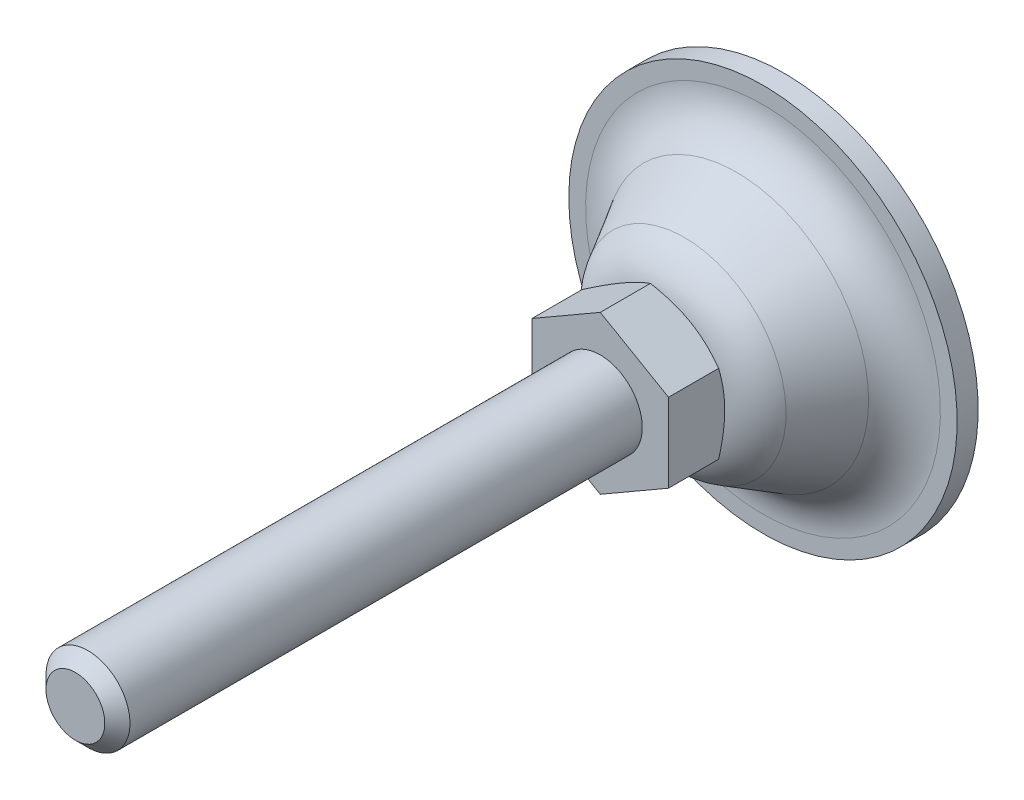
ISO-10303-21;
HEADER;
FILE_DESCRIPTION(('STEP AP214'),'2;1');
FILE_NAME('part.step','',(''),(''),'','','');
FILE_SCHEMA(('AUTOMOTIVE_DESIGN { 1 0 10303 214 1 1 1 1 }'));
ENDSEC;
DATA;
#1=APPLICATION_CONTEXT('core data for automotive mechanical design processes');
#2=APPLICATION_PROTOCOL_DEFINITION('international standard','automotive_design',2000,#1);
#3=PRODUCT_CONTEXT('',#1,'mechanical');
#4=PRODUCT('Part','Part','',(#3));
#5=PRODUCT_RELATED_PRODUCT_CATEGORY('part','',(#4));
#6=PRODUCT_DEFINITION_FORMATION('','',#4);
#7=PRODUCT_DEFINITION_CONTEXT('part definition',#1,'design');
#8=PRODUCT_DEFINITION('design','',#6,#7);
#9=PRODUCT_DEFINITION_SHAPE('','',#8);
#10=(LENGTH_UNIT() NAMED_UNIT(*) SI_UNIT(.MILLI.,.METRE.));
#11=(NAMED_UNIT(*) PLANE_ANGLE_UNIT() SI_UNIT($,.RADIAN.));
#12=(NAMED_UNIT(*) SI_UNIT($,.STERADIAN.) SOLID_ANGLE_UNIT());
#13=UNCERTAINTY_MEASURE_WITH_UNIT(LENGTH_MEASURE(1.E-05),#10,'distance_accuracy_value','');
#14=(GEOMETRIC_REPRESENTATION_CONTEXT(3) GLOBAL_UNCERTAINTY_ASSIGNED_CONTEXT((#13)) GLOBAL_UNIT_ASSIGNED_CONTEXT((#10,
#11,#12)) REPRESENTATION_CONTEXT('',''));
#15=CARTESIAN_POINT('',(0.,0.,0.));
#16=DIRECTION('',(0.,0.,1.));
#17=DIRECTION('',(1.,0.,0.));
#18=AXIS2_PLACEMENT_3D('',#15,#16,#17);
#19=CARTESIAN_POINT('',(-9.25,16.0214699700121,1.9999991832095));
#20=DIRECTION('',(0.,0.,-1.));
#21=DIRECTION('',(-0.5,0.86602540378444,0.));
#22=AXIS2_PLACEMENT_3D('',#19,#20,#21);
#23=PLANE('',#22);
#24=CARTESIAN_POINT('',(0.,0.,1.9999991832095));
#25=DIRECTION('',(0.,0.,1.));
#26=DIRECTION('',(0.5,-0.86602540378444,0.));
#27=AXIS2_PLACEMENT_3D('',#24,#25,#26);
#28=CIRCLE('',#27,16.8976413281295);
#29=CARTESIAN_POINT('',(8.44882066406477,-14.633786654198,1.9999991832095));
#30=VERTEX_POINT('',#29);
#31=EDGE_CURVE('E108',#30,#30,#28,.T.);
#32=ORIENTED_EDGE('',*,*,#31,.F.);
#33=EDGE_LOOP('',(#32));
#34=FACE_BOUND('',#33,.T.);
#35=CARTESIAN_POINT('',(0.,0.,2.));
#36=DIRECTION('',(0.,0.,-1.));
#37=DIRECTION('',(-1.,0.,0.));
#38=AXIS2_PLACEMENT_3D('',#35,#36,#37);
#39=CIRCLE('',#38,18.5);
#40=CARTESIAN_POINT('',(-18.5,0.,2.));
#41=VERTEX_POINT('',#40);
#42=EDGE_CURVE('E206',#41,#41,#39,.T.);
#43=ORIENTED_EDGE('',*,*,#42,.F.);
#44=EDGE_LOOP('',(#43));
#45=FACE_BOUND('',#44,.T.);
#46=ADVANCED_FACE('F14',(#34,#45),#23,.F.);
#47=CARTESIAN_POINT('',(0.,0.,17.5));
#48=DIRECTION('',(0.,0.,1.));
#49=DIRECTION('',(0.5,-0.86602540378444,0.));
#50=AXIS2_PLACEMENT_3D('',#47,#48,#49);
#51=PLANE('',#50);
#52=DIRECTION('',(0.,1.,0.));
#53=VECTOR('',#52,1.);
#54=CARTESIAN_POINT('',(6.5,-3.75277674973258,17.5));
#55=LINE('',#54,#53);
#56=CARTESIAN_POINT('',(6.5,-3.75277674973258,17.5));
#57=VERTEX_POINT('',#56);
#58=CARTESIAN_POINT('',(6.5,3.75277674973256,17.5));
#59=VERTEX_POINT('',#58);
#60=EDGE_CURVE('E371',#57,#59,#55,.T.);
#61=ORIENTED_EDGE('',*,*,#60,.T.);
#62=DIRECTION('',(-0.866025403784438,0.5,0.));
#63=VECTOR('',#62,1.);
#64=CARTESIAN_POINT('',(6.5,3.75277674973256,17.5));
#65=LINE('',#64,#63);
#66=CARTESIAN_POINT('',(0.,7.50555349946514,17.5));
#67=VERTEX_POINT('',#66);
#68=EDGE_CURVE('E368',#59,#67,#65,.T.);
#69=ORIENTED_EDGE('',*,*,#68,.T.);
#70=DIRECTION('',(-0.866025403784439,-0.5,0.));
#71=VECTOR('',#70,1.);
#72=CARTESIAN_POINT('',(0.,7.50555349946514,17.5));
#73=LINE('',#72,#71);
#74=CARTESIAN_POINT('',(-6.5,3.75277674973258,17.5));
#75=VERTEX_POINT('',#74);
#76=EDGE_CURVE('E367',#67,#75,#73,.T.);
#77=ORIENTED_EDGE('',*,*,#76,.T.);
#78=DIRECTION('',(0.,-1.,0.));
#79=VECTOR('',#78,1.);
#80=CARTESIAN_POINT('',(-6.5,3.75277674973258,17.5));
#81=LINE('',#80,#79);
#82=CARTESIAN_POINT('',(-6.5,-3.75277674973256,17.5));
#83=VERTEX_POINT('',#82);
#84=EDGE_CURVE('E375',#75,#83,#81,.T.);
#85=ORIENTED_EDGE('',*,*,#84,.T.);
#86=DIRECTION('',(0.866025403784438,-0.5,0.));
#87=VECTOR('',#86,1.);
#88=CARTESIAN_POINT('',(-6.5,-3.75277674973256,17.5));
#89=LINE('',#88,#87);
#90=CARTESIAN_POINT('',(0.,-7.50555349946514,17.5));
#91=VERTEX_POINT('',#90);
#92=EDGE_CURVE('E377',#83,#91,#89,.T.);
#93=ORIENTED_EDGE('',*,*,#92,.T.);
#94=DIRECTION('',(0.866025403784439,0.5,0.));
#95=VECTOR('',#94,1.);
#96=CARTESIAN_POINT('',(0.,-7.50555349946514,17.5));
#97=LINE('',#96,#95);
#98=EDGE_CURVE('E37',#91,#57,#97,.T.);
#99=ORIENTED_EDGE('',*,*,#98,.T.);
#100=EDGE_LOOP('',(#61,#69,#77,#85,#93,#99));
#101=FACE_BOUND('',#100,.T.);
#102=CARTESIAN_POINT('',(0.,0.,17.5));
#103=DIRECTION('',(0.,0.,1.));
#104=DIRECTION('',(0.5,-0.86602540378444,0.));
#105=AXIS2_PLACEMENT_3D('',#102,#103,#104);
#106=CIRCLE('',#105,4.);
#107=CARTESIAN_POINT('',(2.,-3.46410161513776,17.5));
#108=VERTEX_POINT('',#107);
#109=EDGE_CURVE('E211',#108,#108,#106,.T.);
#110=ORIENTED_EDGE('',*,*,#109,.F.);
#111=EDGE_LOOP('',(#110));
#112=FACE_BOUND('',#111,.T.);
#113=ADVANCED_FACE('F129',(#101,#112),#51,.T.);
#114=CARTESIAN_POINT('',(0.,0.,7.));
#115=DIRECTION('',(0.,0.,1.));
#116=DIRECTION('',(0.5,-0.86602540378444,0.));
#117=AXIS2_PLACEMENT_3D('',#114,#115,#116);
#118=TOROIDAL_SURFACE('',#117,5.36011171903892,5.);
#119=CARTESIAN_POINT('',(0.,0.,12.));
#120=DIRECTION('',(0.,0.,1.));
#121=DIRECTION('',(0.5,-0.86602540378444,0.));
#122=AXIS2_PLACEMENT_3D('',#119,#120,#121);
#123=CIRCLE('',#122,5.36011171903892);
#124=CARTESIAN_POINT('',(2.68005585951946,-4.64199291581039,12.));
#125=VERTEX_POINT('',#124);
#126=EDGE_CURVE('E73',#125,#125,#123,.T.);
#127=ORIENTED_EDGE('',*,*,#126,.F.);
#128=EDGE_LOOP('',(#127));
#129=FACE_BOUND('',#128,.T.);
#130=CARTESIAN_POINT('',(0.,0.,9.49382979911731));
#131=DIRECTION('',(0.,0.,1.));
#132=DIRECTION('',(0.5,-0.86602540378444,0.));
#133=AXIS2_PLACEMENT_3D('',#130,#131,#132);
#134=CIRCLE('',#133,9.69379524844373);
#135=CARTESIAN_POINT('',(4.84689762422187,-8.39507294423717,9.49382979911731));
#136=VERTEX_POINT('',#135);
#137=EDGE_CURVE('E102',#136,#136,#134,.T.);
#138=ORIENTED_EDGE('',*,*,#137,.T.);
#139=EDGE_LOOP('',(#138));
#140=FACE_BOUND('',#139,.T.);
#141=ADVANCED_FACE('F186',(#129,#140),#118,.T.);
#142=CARTESIAN_POINT('',(0.,0.,6.9999991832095));
#143=DIRECTION('',(0.,0.,1.));
#144=DIRECTION('',(0.5,-0.86602540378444,0.));
#145=AXIS2_PLACEMENT_3D('',#142,#143,#144);
#146=TOROIDAL_SURFACE('',#145,16.8976413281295,5.);
#147=CARTESIAN_POINT('',(0.,0.,4.50616938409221));
#148=DIRECTION('',(0.,0.,1.));
#149=DIRECTION('',(0.5,-0.86602540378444,0.));
#150=AXIS2_PLACEMENT_3D('',#147,#148,#149);
#151=CIRCLE('',#150,12.5639577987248);
#152=CARTESIAN_POINT('',(6.28197889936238,-10.8807066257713,4.50616938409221));
#153=VERTEX_POINT('',#152);
#154=EDGE_CURVE('E105',#153,#153,#151,.T.);
#155=ORIENTED_EDGE('',*,*,#154,.F.);
#156=EDGE_LOOP('',(#155));
#157=FACE_BOUND('',#156,.T.);
#158=ORIENTED_EDGE('',*,*,#31,.T.);
#159=EDGE_LOOP('',(#158));
#160=FACE_BOUND('',#159,.T.);
#161=ADVANCED_FACE('F182',(#157,#160),#146,.F.);
#162=CARTESIAN_POINT('',(0.,0.,4.50616938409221));
#163=DIRECTION('',(0.,0.,-1.));
#164=DIRECTION('',(-0.5,0.86602540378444,0.));
#165=AXIS2_PLACEMENT_3D('',#162,#163,#164);
#166=CONICAL_SURFACE('',#165,12.5639577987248,0.522174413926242);
#167=ORIENTED_EDGE('',*,*,#137,.F.);
#168=EDGE_LOOP('',(#167));
#169=FACE_BOUND('',#168,.T.);
#170=ORIENTED_EDGE('',*,*,#154,.T.);
#171=EDGE_LOOP('',(#170));
#172=FACE_BOUND('',#171,.T.);
#173=ADVANCED_FACE('F179',(#169,#172),#166,.T.);
#174=CARTESIAN_POINT('',(0.,0.,12.));
#175=DIRECTION('',(0.,0.,1.));
#176=DIRECTION('',(0.5,-0.86602540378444,0.));
#177=AXIS2_PLACEMENT_3D('',#174,#175,#176);
#178=PLANE('',#177);
#179=CARTESIAN_POINT('',(0.,0.,12.));
#180=DIRECTION('',(0.,0.,-1.));
#181=DIRECTION('',(-0.5,0.86602540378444,0.));
#182=AXIS2_PLACEMENT_3D('',#179,#180,#181);
#183=CIRCLE('',#182,6.25);
#184=CARTESIAN_POINT('',(-3.125,5.41265877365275,12.));
#185=VERTEX_POINT('',#184);
#186=EDGE_CURVE('E84',#185,#185,#183,.T.);
#187=ORIENTED_EDGE('',*,*,#186,.T.);
#188=EDGE_LOOP('',(#187));
#189=FACE_BOUND('',#188,.T.);
#190=ORIENTED_EDGE('',*,*,#126,.T.);
#191=EDGE_LOOP('',(#190));
#192=FACE_BOUND('',#191,.T.);
#193=ADVANCED_FACE('F125',(#189,#192),#178,.F.);
#194=CARTESIAN_POINT('',(0.,0.,13.5200682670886));
#195=DIRECTION('',(0.,0.,1.));
#196=DIRECTION('',(0.5,-0.86602540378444,0.));
#197=AXIS2_PLACEMENT_3D('',#194,#195,#196);
#198=CONICAL_SURFACE('',#197,8.88283546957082,1.0471975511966);
#199=ORIENTED_EDGE('',*,*,#186,.F.);
#200=EDGE_LOOP('',(#199));
#201=FACE_BOUND('',#200,.T.);
#202=CARTESIAN_POINT('',(-5.44790297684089,-10.6509017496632,15.298594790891));
#203=CARTESIAN_POINT('',(-5.20230548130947,-10.5091059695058,15.1611764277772));
#204=CARTESIAN_POINT('',(-4.956140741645,-10.3669826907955,15.0250864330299));
#205=CARTESIAN_POINT('',(-4.46237499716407,-10.0819069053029,14.7563110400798));
#206=CARTESIAN_POINT('',(-4.21477377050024,-9.93895427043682,14.6236261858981));
#207=CARTESIAN_POINT('',(-3.71654215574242,-9.65130011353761,14.3617334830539));
#208=CARTESIAN_POINT('',(-3.46590259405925,-9.50659329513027,14.2325488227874));
#209=CARTESIAN_POINT('',(-2.96261869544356,-9.21602220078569,13.9795158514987));
#210=CARTESIAN_POINT('',(-2.70997445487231,-9.07015798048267,13.8556672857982));
#211=CARTESIAN_POINT('',(-2.19425176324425,-8.77240534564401,13.6109066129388));
#212=CARTESIAN_POINT('',(-1.93109585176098,-8.62047220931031,13.4902109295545));
#213=CARTESIAN_POINT('',(-1.40169322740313,-8.31482146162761,13.2580441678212));
#214=CARTESIAN_POINT('',(-1.13544616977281,-8.16110365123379,13.1465741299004));
#215=CARTESIAN_POINT('',(-0.599947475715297,-7.851933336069,12.93581171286));
#216=CARTESIAN_POINT('',(-0.330703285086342,-7.69648513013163,12.8364943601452));
#217=CARTESIAN_POINT('',(0.211649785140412,-7.38335743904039,12.6532497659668));
#218=CARTESIAN_POINT('',(0.484757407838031,-7.22567867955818,12.569317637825));
#219=CARTESIAN_POINT('',(1.03347068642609,-6.90887892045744,12.4213357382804));
#220=CARTESIAN_POINT('',(1.30905448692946,-6.74977053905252,12.3571796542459));
#221=CARTESIAN_POINT('',(1.86365420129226,-6.42957224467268,12.2524174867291));
#222=CARTESIAN_POINT('',(2.14266979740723,-6.2684825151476,12.2118092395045));
#223=CARTESIAN_POINT('',(2.56080401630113,-6.0270726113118,12.1712550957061));
#224=CARTESIAN_POINT('',(2.69921737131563,-5.94715962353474,12.1611313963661));
#225=CARTESIAN_POINT('',(2.9762968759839,-5.78718769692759,12.1476434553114));
#226=CARTESIAN_POINT('',(3.11496302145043,-5.707128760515,12.1442791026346));
#227=CARTESIAN_POINT('',(3.39229296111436,-5.54701224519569,12.1443975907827));
#228=CARTESIAN_POINT('',(3.53095675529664,-5.46695466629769,12.1478804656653));
#229=CARTESIAN_POINT('',(3.80803537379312,-5.30698325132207,12.1616069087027));
#230=CARTESIAN_POINT('',(3.94645018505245,-5.22706942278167,12.17185082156));
#231=CARTESIAN_POINT('',(4.28007777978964,-5.03444944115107,12.2044757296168));
#232=CARTESIAN_POINT('',(4.47505560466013,-4.92187894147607,12.2301273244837));
#233=CARTESIAN_POINT('',(4.86353391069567,-4.69759088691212,12.2934390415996));
#234=CARTESIAN_POINT('',(5.05703418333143,-4.5858734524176,12.3311008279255));
#235=CARTESIAN_POINT('',(5.63511426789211,-4.25211875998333,12.4601015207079));
#236=CARTESIAN_POINT('',(6.01705147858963,-4.03160720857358,12.5674312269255));
#237=CARTESIAN_POINT('',(6.58811023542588,-3.70190628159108,12.7531116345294));
#238=CARTESIAN_POINT('',(6.78020331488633,-3.59100129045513,12.8199741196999));
#239=CARTESIAN_POINT('',(7.16252306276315,-3.37026888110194,12.9605341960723));
#240=CARTESIAN_POINT('',(7.35274971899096,-3.26044146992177,13.0342318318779));
#241=CARTESIAN_POINT('',(7.73139832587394,-3.0418285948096,13.1872888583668));
#242=CARTESIAN_POINT('',(7.91982086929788,-2.9330427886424,13.2666463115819));
#243=CARTESIAN_POINT('',(8.29511118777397,-2.71636882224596,13.4301001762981));
#244=CARTESIAN_POINT('',(8.48197897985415,-2.6084806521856,13.514196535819));
#245=CARTESIAN_POINT('',(8.91814267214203,-2.35666142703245,13.7158388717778));
#246=CARTESIAN_POINT('',(9.16688725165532,-2.213048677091,13.8349718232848));
#247=CARTESIAN_POINT('',(9.66230392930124,-1.92701972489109,14.0788671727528));
#248=CARTESIAN_POINT('',(9.90897590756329,-1.78460359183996,14.2036298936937));
#249=CARTESIAN_POINT('',(10.4006223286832,-1.50075139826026,14.4576697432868));
#250=CARTESIAN_POINT('',(10.6455964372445,-1.35931553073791,14.5869477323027));
#251=CARTESIAN_POINT('',(11.1340885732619,-1.07728446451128,14.8491274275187));
#252=CARTESIAN_POINT('',(11.3776065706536,-0.936689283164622,14.9820292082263));
#253=CARTESIAN_POINT('',(11.8636665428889,-0.656062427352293,15.2509206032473));
#254=CARTESIAN_POINT('',(12.1062072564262,-0.51603148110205,15.3869132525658));
#255=CARTESIAN_POINT('',(12.5902533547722,-0.236567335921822,15.6613356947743));
#256=CARTESIAN_POINT('',(12.8317587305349,-0.0971341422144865,15.7997655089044));
#257=CARTESIAN_POINT('',(13.5549050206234,0.320374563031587,16.2180352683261));
#258=CARTESIAN_POINT('',(14.0352379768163,0.597694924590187,16.5008900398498));
#259=CARTESIAN_POINT('',(14.9539821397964,1.12813211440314,17.0487944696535));
#260=CARTESIAN_POINT('',(15.3925942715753,1.38136494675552,17.3133968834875));
#261=CARTESIAN_POINT('',(16.2681858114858,1.88688795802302,17.8462176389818));
#262=CARTESIAN_POINT('',(16.7051651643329,2.13917810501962,18.1144361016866));
#263=CARTESIAN_POINT('',(17.5767965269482,2.64241470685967,18.652983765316));
#264=CARTESIAN_POINT('',(18.0114516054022,2.89336293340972,18.9233063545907));
#265=CARTESIAN_POINT('',(18.8797150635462,3.39465507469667,19.4661210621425));
#266=CARTESIAN_POINT('',(19.3133234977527,3.64499902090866,19.7386130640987));
#267=CARTESIAN_POINT('',(19.7465453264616,3.89511976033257,20.0119166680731));
#268=B_SPLINE_CURVE_WITH_KNOTS('',3,(#202,#203,#204,#205,#206,#207,#208,#209,#210,#211,#212,
#213,#214,#215,#216,#217,#218,#219,#220,#221,#222,#223,#224,#225,#226,#227,#228,#229,#230,#231,
#232,#233,#234,#235,#236,#237,#238,#239,#240,#241,#242,#243,#244,#245,#246,#247,#248,#249,#250,
#251,#252,#253,#254,#255,#256,#257,#258,#259,#260,#261,#262,#263,#264,#265,#266,#267),
.UNSPECIFIED.,.F.,.F.,(4,2,2,2,2,2,2,2,2,2,2,2,2,2,2,2,2,2,2,2,2,2,2,2,2,2,2,2,2,2,2,2,4),(0.,
0.945406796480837,1.89096370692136,2.84173097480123,3.79245281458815,4.77321406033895,
5.75408576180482,6.73290667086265,7.71141614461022,8.68456969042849,9.65763380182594,
10.1379514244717,10.6182611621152,11.0985732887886,11.5789099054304,12.2583181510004,
12.9378205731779,14.2975940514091,14.9925427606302,15.6874960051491,16.3822124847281,
17.0769213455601,18.0096970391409,18.94252631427,19.875534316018,20.8085615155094,
21.7425482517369,22.6765431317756,24.5442948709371,26.2585421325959,27.9728469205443,
29.6830369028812,31.393135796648),.UNSPECIFIED.);
#269=CARTESIAN_POINT('',(0.,-7.50555349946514,12.7248941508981));
#270=VERTEX_POINT('',#269);
#271=CARTESIAN_POINT('',(6.5,-3.75277674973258,12.7248941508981));
#272=VERTEX_POINT('',#271);
#273=EDGE_CURVE('E65',#270,#272,#268,.T.);
#274=ORIENTED_EDGE('',*,*,#273,.F.);
#275=CARTESIAN_POINT('',(-6.5002,-3.75266127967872,12.7249608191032));
#276=CARTESIAN_POINT('',(-6.35732254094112,-3.8351516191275,12.6773419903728));
#277=CARTESIAN_POINT('',(-6.21391236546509,-3.91794952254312,12.6318842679));
#278=CARTESIAN_POINT('',(-5.92592736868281,-4.08421773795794,12.5458862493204));
#279=CARTESIAN_POINT('',(-5.78135207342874,-4.16768832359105,12.5053480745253));
#280=CARTESIAN_POINT('',(-5.34531134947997,-4.41943655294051,12.3919085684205));
#281=CARTESIAN_POINT('',(-5.05212471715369,-4.58870793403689,12.327385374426));
#282=CARTESIAN_POINT('',(-4.61337625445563,-4.84201947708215,12.2517241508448));
#283=CARTESIAN_POINT('',(-4.46912536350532,-4.92530276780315,12.2301704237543));
#284=CARTESIAN_POINT('',(-4.17997178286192,-5.09224566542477,12.1940278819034));
#285=CARTESIAN_POINT('',(-4.03506915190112,-5.17590523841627,12.179438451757));
#286=CARTESIAN_POINT('',(-3.74501222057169,-5.34336968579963,12.1575963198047));
#287=CARTESIAN_POINT('',(-3.5998583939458,-5.42717428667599,12.1503352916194));
#288=CARTESIAN_POINT('',(-3.30942466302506,-5.59485627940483,12.1432978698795));
#289=CARTESIAN_POINT('',(-3.16414476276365,-5.6787336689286,12.1435212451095));
#290=CARTESIAN_POINT('',(-2.76612405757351,-5.90853103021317,12.1544210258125));
#291=CARTESIAN_POINT('',(-2.51351353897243,-6.05437578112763,12.1727193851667));
#292=CARTESIAN_POINT('',(-2.00997032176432,-6.34509659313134,12.230743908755));
#293=CARTESIAN_POINT('',(-1.75903939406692,-6.48997163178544,12.2704899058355));
#294=CARTESIAN_POINT('',(-1.25448277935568,-6.78127752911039,12.3698434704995));
#295=CARTESIAN_POINT('',(-1.00092075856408,-6.92767163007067,12.4298719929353));
#296=CARTESIAN_POINT('',(-0.497578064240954,-7.21827667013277,12.5661125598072));
#297=CARTESIAN_POINT('',(-0.247790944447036,-7.36249133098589,12.6422926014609));
#298=CARTESIAN_POINT('',(0.00019999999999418,-7.50566896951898,12.7249608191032));
#299=B_SPLINE_CURVE_WITH_KNOTS('',3,(#275,#276,#277,#278,#279,#280,#281,#282,#283,#284,#285,
#286,#287,#288,#289,#290,#291,#292,#293,#294,#295,#296,#297,#298),.UNSPECIFIED.,.F.,.F.,(4,2,2,
2,2,2,2,2,2,2,2,4),(0.,0.515105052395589,1.03043143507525,2.06322554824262,2.56697389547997,
3.07067772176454,3.57380860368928,4.07692394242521,4.95279354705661,5.82947446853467,
6.72559912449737,7.61996451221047),.UNSPECIFIED.);
#300=CARTESIAN_POINT('',(-6.5,-3.75277674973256,12.7248941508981));
#301=VERTEX_POINT('',#300);
#302=EDGE_CURVE('E68',#301,#270,#299,.T.);
#303=ORIENTED_EDGE('',*,*,#302,.F.);
#304=CARTESIAN_POINT('',(-6.5,3.75300768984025,12.7249608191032));
#305=CARTESIAN_POINT('',(-6.5,3.58802701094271,12.6773419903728));
#306=CARTESIAN_POINT('',(-6.5,3.42243120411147,12.6318842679));
#307=CARTESIAN_POINT('',(-6.5,3.08989477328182,12.5458862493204));
#308=CARTESIAN_POINT('',(-6.5,2.92295360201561,12.5053480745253));
#309=CARTESIAN_POINT('',(-6.5,2.41945714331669,12.3919085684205));
#310=CARTESIAN_POINT('',(-6.5,2.08091438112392,12.327385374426));
#311=CARTESIAN_POINT('',(-6.5,1.57429129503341,12.2517241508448));
#312=CARTESIAN_POINT('',(-6.5,1.40772471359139,12.2301704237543));
#313=CARTESIAN_POINT('',(-6.5,1.07383891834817,12.1940278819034));
#314=CARTESIAN_POINT('',(-6.5,0.906519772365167,12.179438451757));
#315=CARTESIAN_POINT('',(-6.5,0.571590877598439,12.1575963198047));
#316=CARTESIAN_POINT('',(-6.50000000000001,0.403981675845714,12.1503352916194));
#317=CARTESIAN_POINT('',(-6.5,0.0686176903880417,12.1432978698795));
#318=CARTESIAN_POINT('',(-6.5,-0.0991370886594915,12.1435212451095));
#319=CARTESIAN_POINT('',(-6.5,-0.558731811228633,12.1544210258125));
#320=CARTESIAN_POINT('',(-6.5,-0.85042131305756,12.1727193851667));
#321=CARTESIAN_POINT('',(-6.50000000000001,-1.43186293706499,12.230743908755));
#322=CARTESIAN_POINT('',(-6.50000000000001,-1.72161301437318,12.2704899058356));
#323=CARTESIAN_POINT('',(-6.50000000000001,-2.30422480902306,12.3698434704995));
#324=CARTESIAN_POINT('',(-6.50000000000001,-2.59701301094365,12.4298719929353));
#325=CARTESIAN_POINT('',(-6.50000000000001,-3.17822309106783,12.5661125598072));
#326=CARTESIAN_POINT('',(-6.50000000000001,-3.46665241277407,12.6422926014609));
#327=CARTESIAN_POINT('',(-6.5,-3.75300768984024,12.7249608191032));
#328=B_SPLINE_CURVE_WITH_KNOTS('',3,(#304,#305,#306,#307,#308,#309,#310,#311,#312,#313,#314,
#315,#316,#317,#318,#319,#320,#321,#322,#323,#324,#325,#326,#327),.UNSPECIFIED.,.F.,.F.,(4,2,2,
2,2,2,2,2,2,2,2,4),(0.,0.51510505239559,1.03043143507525,2.06322554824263,2.56697389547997,
3.07067772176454,3.57380860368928,4.07692394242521,4.95279354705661,5.82947446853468,
6.72559912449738,7.61996451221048),.UNSPECIFIED.);
#329=CARTESIAN_POINT('',(-6.5,3.75277674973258,12.7248941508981));
#330=VERTEX_POINT('',#329);
#331=EDGE_CURVE('E83',#330,#301,#328,.T.);
#332=ORIENTED_EDGE('',*,*,#331,.F.);
#333=CARTESIAN_POINT('',(-11.9479029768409,0.607428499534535,15.298594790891));
#334=CARTESIAN_POINT('',(-11.7023054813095,0.749224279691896,15.1611764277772));
#335=CARTESIAN_POINT('',(-11.456140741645,0.891347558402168,15.0250864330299));
#336=CARTESIAN_POINT('',(-10.9623749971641,1.17642334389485,14.7563110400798));
#337=CARTESIAN_POINT('',(-10.7147737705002,1.31937597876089,14.6236261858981));
#338=CARTESIAN_POINT('',(-10.2165421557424,1.6070301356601,14.3617334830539));
#339=CARTESIAN_POINT('',(-9.96590259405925,1.75173695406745,14.2325488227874));
#340=CARTESIAN_POINT('',(-9.46261869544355,2.04230804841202,13.9795158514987));
#341=CARTESIAN_POINT('',(-9.2099744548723,2.18817226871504,13.8556672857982));
#342=CARTESIAN_POINT('',(-8.69425176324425,2.4859249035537,13.6109066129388));
#343=CARTESIAN_POINT('',(-8.43109585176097,2.63785803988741,13.4902109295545));
#344=CARTESIAN_POINT('',(-7.90169322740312,2.94350878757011,13.2580441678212));
#345=CARTESIAN_POINT('',(-7.6354461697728,3.09722659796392,13.1465741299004));
#346=CARTESIAN_POINT('',(-7.09994747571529,3.40639691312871,12.93581171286));
#347=CARTESIAN_POINT('',(-6.83070328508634,3.56184511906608,12.8364943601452));
#348=CARTESIAN_POINT('',(-6.28835021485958,3.87497281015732,12.6532497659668));
#349=CARTESIAN_POINT('',(-6.01524259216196,4.03265156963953,12.569317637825));
#350=CARTESIAN_POINT('',(-5.4665293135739,4.34945132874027,12.4213357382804));
#351=CARTESIAN_POINT('',(-5.19094551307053,4.50855971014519,12.3571796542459));
#352=CARTESIAN_POINT('',(-4.63634579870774,4.82875800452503,12.2524174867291));
#353=CARTESIAN_POINT('',(-4.35733020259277,4.98984773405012,12.2118092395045));
#354=CARTESIAN_POINT('',(-3.93919598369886,5.23125763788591,12.1712550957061));
#355=CARTESIAN_POINT('',(-3.80078262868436,5.31117062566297,12.1611313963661));
#356=CARTESIAN_POINT('',(-3.52370312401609,5.47114255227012,12.1476434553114));
#357=CARTESIAN_POINT('',(-3.38503697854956,5.55120148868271,12.1442791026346));
#358=CARTESIAN_POINT('',(-3.10770703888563,5.71131800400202,12.1443975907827));
#359=CARTESIAN_POINT('',(-2.96904324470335,5.79137558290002,12.1478804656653));
#360=CARTESIAN_POINT('',(-2.69196462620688,5.95134699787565,12.1616069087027));
#361=CARTESIAN_POINT('',(-2.55354981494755,6.03126082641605,12.17185082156));
#362=CARTESIAN_POINT('',(-2.21992222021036,6.22388080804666,12.2044757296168));
#363=CARTESIAN_POINT('',(-2.02494439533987,6.33645130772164,12.2301273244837));
#364=CARTESIAN_POINT('',(-1.63646608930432,6.56073936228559,12.2934390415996));
#365=CARTESIAN_POINT('',(-1.44296581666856,6.67245679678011,12.3311008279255));
#366=CARTESIAN_POINT('',(-0.864885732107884,7.00621148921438,12.4601015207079));
#367=CARTESIAN_POINT('',(-0.482948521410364,7.22672304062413,12.5674312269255));
#368=CARTESIAN_POINT('',(0.0881102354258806,7.55642396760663,12.7531116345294));
#369=CARTESIAN_POINT('',(0.280203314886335,7.66732895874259,12.8199741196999));
#370=CARTESIAN_POINT('',(0.662523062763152,7.88806136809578,12.9605341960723));
#371=CARTESIAN_POINT('',(0.852749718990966,7.99788877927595,13.0342318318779));
#372=CARTESIAN_POINT('',(1.23139832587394,8.21650165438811,13.1872888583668));
#373=CARTESIAN_POINT('',(1.41982086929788,8.32528746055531,13.2666463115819));
#374=CARTESIAN_POINT('',(1.79511118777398,8.54196142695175,13.4301001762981));
#375=CARTESIAN_POINT('',(1.98197897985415,8.64984959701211,13.514196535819));
#376=CARTESIAN_POINT('',(2.41814267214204,8.90166882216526,13.7158388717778));
#377=CARTESIAN_POINT('',(2.66688725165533,9.04528157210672,13.8349718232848));
#378=CARTESIAN_POINT('',(3.16230392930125,9.33131052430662,14.0788671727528));
#379=CARTESIAN_POINT('',(3.4089759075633,9.47372665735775,14.2036298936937));
#380=CARTESIAN_POINT('',(3.90062232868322,9.75757885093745,14.4576697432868));
#381=CARTESIAN_POINT('',(4.14559643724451,9.8990147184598,14.5869477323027));
#382=CARTESIAN_POINT('',(4.63408857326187,10.1810457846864,14.8491274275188));
#383=CARTESIAN_POINT('',(4.87760657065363,10.3216409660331,14.9820292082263));
#384=CARTESIAN_POINT('',(5.36366654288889,10.6022678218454,15.2509206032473));
#385=CARTESIAN_POINT('',(5.60620725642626,10.7422987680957,15.3869132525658));
#386=CARTESIAN_POINT('',(6.09025335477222,11.0217629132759,15.6613356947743));
#387=CARTESIAN_POINT('',(6.33175873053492,11.1611961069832,15.7997655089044));
#388=CARTESIAN_POINT('',(7.05490502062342,11.5787048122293,16.2180352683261));
#389=CARTESIAN_POINT('',(7.53523797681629,11.8560251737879,16.5008900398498));
#390=CARTESIAN_POINT('',(8.45398213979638,12.3864623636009,17.0487944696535));
#391=CARTESIAN_POINT('',(8.89259427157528,12.6396951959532,17.3133968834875));
#392=CARTESIAN_POINT('',(9.76818581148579,13.1452182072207,17.8462176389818));
#393=CARTESIAN_POINT('',(10.2051651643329,13.3975083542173,18.1144361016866));
#394=CARTESIAN_POINT('',(11.0767965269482,13.9007449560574,18.652983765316));
#395=CARTESIAN_POINT('',(11.5114516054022,14.1516931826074,18.9233063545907));
#396=CARTESIAN_POINT('',(12.3797150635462,14.6529853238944,19.4661210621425));
#397=CARTESIAN_POINT('',(12.8133234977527,14.9033292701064,19.7386130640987));
#398=CARTESIAN_POINT('',(13.2465453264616,15.1534500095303,20.0119166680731));
#399=B_SPLINE_CURVE_WITH_KNOTS('',3,(#333,#334,#335,#336,#337,#338,#339,#340,#341,#342,#343,
#344,#345,#346,#347,#348,#349,#350,#351,#352,#353,#354,#355,#356,#357,#358,#359,#360,#361,#362,
#363,#364,#365,#366,#367,#368,#369,#370,#371,#372,#373,#374,#375,#376,#377,#378,#379,#380,#381,
#382,#383,#384,#385,#386,#387,#388,#389,#390,#391,#392,#393,#394,#395,#396,#397,#398),
.UNSPECIFIED.,.F.,.F.,(4,2,2,2,2,2,2,2,2,2,2,2,2,2,2,2,2,2,2,2,2,2,2,2,2,2,2,2,2,2,2,2,4),(0.,
0.945406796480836,1.89096370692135,2.84173097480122,3.79245281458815,4.77321406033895,
5.75408576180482,6.73290667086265,7.71141614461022,8.68456969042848,9.65763380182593,
10.1379514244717,10.6182611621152,11.0985732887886,11.5789099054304,12.2583181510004,
12.9378205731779,14.2975940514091,14.9925427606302,15.6874960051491,16.3822124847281,
17.0769213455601,18.0096970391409,18.94252631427,19.875534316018,20.8085615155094,
21.7425482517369,22.6765431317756,24.5442948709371,26.2585421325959,27.9728469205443,
29.6830369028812,31.393135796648),.UNSPECIFIED.);
#400=CARTESIAN_POINT('',(0.,7.50555349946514,12.7248941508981));
#401=VERTEX_POINT('',#400);
#402=EDGE_CURVE('E148',#401,#330,#399,.F.);
#403=ORIENTED_EDGE('',*,*,#402,.F.);
#404=CARTESIAN_POINT('',(6.5002,3.75266127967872,12.7249608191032));
#405=CARTESIAN_POINT('',(6.35732254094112,3.8351516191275,12.6773419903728));
#406=CARTESIAN_POINT('',(6.21391236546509,3.91794952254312,12.6318842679));
#407=CARTESIAN_POINT('',(5.92592736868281,4.08421773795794,12.5458862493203));
#408=CARTESIAN_POINT('',(5.78135207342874,4.16768832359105,12.5053480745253));
#409=CARTESIAN_POINT('',(5.34531134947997,4.41943655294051,12.3919085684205));
#410=CARTESIAN_POINT('',(5.05212471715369,4.58870793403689,12.327385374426));
#411=CARTESIAN_POINT('',(4.61337625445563,4.84201947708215,12.2517241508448));
#412=CARTESIAN_POINT('',(4.46912536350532,4.92530276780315,12.2301704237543));
#413=CARTESIAN_POINT('',(4.17997178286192,5.09224566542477,12.1940278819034));
#414=CARTESIAN_POINT('',(4.03506915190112,5.17590523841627,12.179438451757));
#415=CARTESIAN_POINT('',(3.74501222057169,5.34336968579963,12.1575963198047));
#416=CARTESIAN_POINT('',(3.5998583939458,5.42717428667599,12.1503352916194));
#417=CARTESIAN_POINT('',(3.30942466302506,5.59485627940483,12.1432978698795));
#418=CARTESIAN_POINT('',(3.16414476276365,5.6787336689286,12.1435212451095));
#419=CARTESIAN_POINT('',(2.76612405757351,5.90853103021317,12.1544210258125));
#420=CARTESIAN_POINT('',(2.51351353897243,6.05437578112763,12.1727193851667));
#421=CARTESIAN_POINT('',(2.00997032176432,6.34509659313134,12.230743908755));
#422=CARTESIAN_POINT('',(1.75903939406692,6.48997163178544,12.2704899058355));
#423=CARTESIAN_POINT('',(1.25448277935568,6.78127752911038,12.3698434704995));
#424=CARTESIAN_POINT('',(1.00092075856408,6.92767163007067,12.4298719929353));
#425=CARTESIAN_POINT('',(0.497578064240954,7.21827667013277,12.5661125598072));
#426=CARTESIAN_POINT('',(0.247790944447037,7.36249133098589,12.6422926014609));
#427=CARTESIAN_POINT('',(-0.000199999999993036,7.50566896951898,12.7249608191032));
#428=B_SPLINE_CURVE_WITH_KNOTS('',3,(#404,#405,#406,#407,#408,#409,#410,#411,#412,#413,#414,
#415,#416,#417,#418,#419,#420,#421,#422,#423,#424,#425,#426,#427),.UNSPECIFIED.,.F.,.F.,(4,2,2,
2,2,2,2,2,2,2,2,4),(0.,0.51510505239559,1.03043143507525,2.06322554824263,2.56697389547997,
3.07067772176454,3.57380860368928,4.07692394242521,4.95279354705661,5.82947446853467,
6.72559912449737,7.61996451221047),.UNSPECIFIED.);
#429=CARTESIAN_POINT('',(6.5,3.75277674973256,12.7248941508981));
#430=VERTEX_POINT('',#429);
#431=EDGE_CURVE('E155',#430,#401,#428,.T.);
#432=ORIENTED_EDGE('',*,*,#431,.F.);
#433=CARTESIAN_POINT('',(6.5,-3.75300768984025,12.7249608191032));
#434=CARTESIAN_POINT('',(6.5,-3.5880270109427,12.6773419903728));
#435=CARTESIAN_POINT('',(6.5,-3.42243120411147,12.6318842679));
#436=CARTESIAN_POINT('',(6.5,-3.08989477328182,12.5458862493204));
#437=CARTESIAN_POINT('',(6.5,-2.92295360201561,12.5053480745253));
#438=CARTESIAN_POINT('',(6.5,-2.41945714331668,12.3919085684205));
#439=CARTESIAN_POINT('',(6.5,-2.08091438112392,12.327385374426));
#440=CARTESIAN_POINT('',(6.5,-1.57429129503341,12.2517241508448));
#441=CARTESIAN_POINT('',(6.5,-1.40772471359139,12.2301704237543));
#442=CARTESIAN_POINT('',(6.5,-1.07383891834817,12.1940278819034));
#443=CARTESIAN_POINT('',(6.5,-0.906519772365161,12.179438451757));
#444=CARTESIAN_POINT('',(6.5,-0.571590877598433,12.1575963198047));
#445=CARTESIAN_POINT('',(6.50000000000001,-0.403981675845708,12.1503352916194));
#446=CARTESIAN_POINT('',(6.5,-0.0686176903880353,12.1432978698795));
#447=CARTESIAN_POINT('',(6.5,0.0991370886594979,12.1435212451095));
#448=CARTESIAN_POINT('',(6.5,0.558731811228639,12.1544210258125));
#449=CARTESIAN_POINT('',(6.5,0.850421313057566,12.1727193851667));
#450=CARTESIAN_POINT('',(6.50000000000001,1.43186293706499,12.230743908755));
#451=CARTESIAN_POINT('',(6.50000000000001,1.72161301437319,12.2704899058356));
#452=CARTESIAN_POINT('',(6.50000000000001,2.30422480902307,12.3698434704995));
#453=CARTESIAN_POINT('',(6.50000000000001,2.59701301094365,12.4298719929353));
#454=CARTESIAN_POINT('',(6.50000000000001,3.17822309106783,12.5661125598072));
#455=CARTESIAN_POINT('',(6.50000000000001,3.46665241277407,12.6422926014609));
#456=CARTESIAN_POINT('',(6.5,3.75300768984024,12.7249608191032));
#457=B_SPLINE_CURVE_WITH_KNOTS('',3,(#433,#434,#435,#436,#437,#438,#439,#440,#441,#442,#443,
#444,#445,#446,#447,#448,#449,#450,#451,#452,#453,#454,#455,#456),.UNSPECIFIED.,.F.,.F.,(4,2,2,
2,2,2,2,2,2,2,2,4),(0.,0.51510505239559,1.03043143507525,2.06322554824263,2.56697389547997,
3.07067772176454,3.57380860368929,4.07692394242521,4.95279354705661,5.82947446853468,
6.72559912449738,7.61996451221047),.UNSPECIFIED.);
#458=EDGE_CURVE('E29',#272,#430,#457,.T.);
#459=ORIENTED_EDGE('',*,*,#458,.F.);
#460=EDGE_LOOP('',(#274,#303,#332,#403,#432,#459));
#461=FACE_BOUND('',#460,.T.);
#462=ADVANCED_FACE('F67',(#201,#461),#198,.T.);
#463=CARTESIAN_POINT('',(0.,-7.50555349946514,17.5));
#464=DIRECTION('',(-0.5,0.86602540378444,0.));
#465=DIRECTION('',(-0.866025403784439,-0.5,0.));
#466=AXIS2_PLACEMENT_3D('',#463,#464,#465);
#467=PLANE('',#466);
#468=DIRECTION('',(0.,0.,-1.));
#469=VECTOR('',#468,1.);
#470=CARTESIAN_POINT('',(0.,-7.50555349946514,17.5));
#471=LINE('',#470,#469);
#472=EDGE_CURVE('E80',#91,#270,#471,.T.);
#473=ORIENTED_EDGE('',*,*,#472,.T.);
#474=ORIENTED_EDGE('',*,*,#273,.T.);
#475=DIRECTION('',(0.,0.,-1.));
#476=VECTOR('',#475,1.);
#477=CARTESIAN_POINT('',(6.5,-3.75277674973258,17.5));
#478=LINE('',#477,#476);
#479=EDGE_CURVE('E87',#57,#272,#478,.T.);
#480=ORIENTED_EDGE('',*,*,#479,.F.);
#481=ORIENTED_EDGE('',*,*,#98,.F.);
#482=EDGE_LOOP('',(#473,#474,#480,#481));
#483=FACE_BOUND('',#482,.T.);
#484=ADVANCED_FACE('F86',(#483),#467,.F.);
#485=CARTESIAN_POINT('',(-6.5,-3.75277674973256,17.5));
#486=DIRECTION('',(0.5,0.866025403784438,0.));
#487=DIRECTION('',(-0.866025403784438,0.5,0.));
#488=AXIS2_PLACEMENT_3D('',#485,#486,#487);
#489=PLANE('',#488);
#490=DIRECTION('',(0.,0.,-1.));
#491=VECTOR('',#490,1.);
#492=CARTESIAN_POINT('',(-6.5,-3.75277674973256,17.5));
#493=LINE('',#492,#491);
#494=EDGE_CURVE('E82',#83,#301,#493,.T.);
#495=ORIENTED_EDGE('',*,*,#494,.T.);
#496=ORIENTED_EDGE('',*,*,#302,.T.);
#497=ORIENTED_EDGE('',*,*,#472,.F.);
#498=ORIENTED_EDGE('',*,*,#92,.F.);
#499=EDGE_LOOP('',(#495,#496,#497,#498));
#500=FACE_BOUND('',#499,.T.);
#501=ADVANCED_FACE('F78',(#500),#489,.F.);
#502=CARTESIAN_POINT('',(-6.5,3.75277674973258,17.5));
#503=DIRECTION('',(1.,0.,0.));
#504=DIRECTION('',(0.,1.,0.));
#505=AXIS2_PLACEMENT_3D('',#502,#503,#504);
#506=PLANE('',#505);
#507=DIRECTION('',(0.,0.,-1.));
#508=VECTOR('',#507,1.);
#509=CARTESIAN_POINT('',(-6.5,3.75277674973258,17.5));
#510=LINE('',#509,#508);
#511=EDGE_CURVE('E89',#75,#330,#510,.T.);
#512=ORIENTED_EDGE('',*,*,#511,.T.);
#513=ORIENTED_EDGE('',*,*,#331,.T.);
#514=ORIENTED_EDGE('',*,*,#494,.F.);
#515=ORIENTED_EDGE('',*,*,#84,.F.);
#516=EDGE_LOOP('',(#512,#513,#514,#515));
#517=FACE_BOUND('',#516,.T.);
#518=ADVANCED_FACE('F241',(#517),#506,.F.);
#519=CARTESIAN_POINT('',(0.,7.50555349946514,17.5));
#520=DIRECTION('',(0.5,-0.86602540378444,0.));
#521=DIRECTION('',(0.866025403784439,0.5,0.));
#522=AXIS2_PLACEMENT_3D('',#519,#520,#521);
#523=PLANE('',#522);
#524=DIRECTION('',(0.,0.,-1.));
#525=VECTOR('',#524,1.);
#526=CARTESIAN_POINT('',(0.,7.50555349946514,17.5));
#527=LINE('',#526,#525);
#528=EDGE_CURVE('E96',#67,#401,#527,.T.);
#529=ORIENTED_EDGE('',*,*,#528,.T.);
#530=ORIENTED_EDGE('',*,*,#402,.T.);
#531=ORIENTED_EDGE('',*,*,#511,.F.);
#532=ORIENTED_EDGE('',*,*,#76,.F.);
#533=EDGE_LOOP('',(#529,#530,#531,#532));
#534=FACE_BOUND('',#533,.T.);
#535=ADVANCED_FACE('F172',(#534),#523,.F.);
#536=CARTESIAN_POINT('',(6.5,3.75277674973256,17.5));
#537=DIRECTION('',(-0.5,-0.866025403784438,0.));
#538=DIRECTION('',(0.866025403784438,-0.5,0.));
#539=AXIS2_PLACEMENT_3D('',#536,#537,#538);
#540=PLANE('',#539);
#541=DIRECTION('',(0.,0.,-1.));
#542=VECTOR('',#541,1.);
#543=CARTESIAN_POINT('',(6.5,3.75277674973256,17.5));
#544=LINE('',#543,#542);
#545=EDGE_CURVE('E99',#59,#430,#544,.T.);
#546=ORIENTED_EDGE('',*,*,#545,.T.);
#547=ORIENTED_EDGE('',*,*,#431,.T.);
#548=ORIENTED_EDGE('',*,*,#528,.F.);
#549=ORIENTED_EDGE('',*,*,#68,.F.);
#550=EDGE_LOOP('',(#546,#547,#548,#549));
#551=FACE_BOUND('',#550,.T.);
#552=ADVANCED_FACE('F168',(#551),#540,.F.);
#553=CARTESIAN_POINT('',(6.5,-3.75277674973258,17.5));
#554=DIRECTION('',(-1.,0.,0.));
#555=DIRECTION('',(0.,-1.,0.));
#556=AXIS2_PLACEMENT_3D('',#553,#554,#555);
#557=PLANE('',#556);
#558=ORIENTED_EDGE('',*,*,#479,.T.);
#559=ORIENTED_EDGE('',*,*,#458,.T.);
#560=ORIENTED_EDGE('',*,*,#545,.F.);
#561=ORIENTED_EDGE('',*,*,#60,.F.);
#562=EDGE_LOOP('',(#558,#559,#560,#561));
#563=FACE_BOUND('',#562,.T.);
#564=ADVANCED_FACE('F171',(#563),#557,.F.);
#565=CARTESIAN_POINT('',(0.,0.,67.5));
#566=DIRECTION('',(0.,0.,-1.));
#567=DIRECTION('',(-0.5,0.86602540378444,0.));
#568=AXIS2_PLACEMENT_3D('',#565,#566,#567);
#569=CYLINDRICAL_SURFACE('',#568,4.);
#570=CARTESIAN_POINT('',(0.,0.,66.3));
#571=DIRECTION('',(0.,0.,1.));
#572=DIRECTION('',(0.5,-0.86602540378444,0.));
#573=AXIS2_PLACEMENT_3D('',#570,#571,#572);
#574=CIRCLE('',#573,4.);
#575=CARTESIAN_POINT('',(2.,-3.46410161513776,66.3));
#576=VERTEX_POINT('',#575);
#577=EDGE_CURVE('E9',#576,#576,#574,.F.);
#578=ORIENTED_EDGE('',*,*,#577,.T.);
#579=EDGE_LOOP('',(#578));
#580=FACE_BOUND('',#579,.T.);
#581=ORIENTED_EDGE('',*,*,#109,.T.);
#582=EDGE_LOOP('',(#581));
#583=FACE_BOUND('',#582,.T.);
#584=ADVANCED_FACE('F127',(#580,#583),#569,.T.);
#585=CARTESIAN_POINT('',(0.,0.,67.5));
#586=DIRECTION('',(0.,0.,1.));
#587=DIRECTION('',(0.5,-0.86602540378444,0.));
#588=AXIS2_PLACEMENT_3D('',#585,#586,#587);
#589=PLANE('',#588);
#590=CARTESIAN_POINT('',(0.,0.,67.5));
#591=DIRECTION('',(0.,0.,1.));
#592=DIRECTION('',(0.5,-0.86602540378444,0.));
#593=AXIS2_PLACEMENT_3D('',#590,#591,#592);
#594=CIRCLE('',#593,2.8);
#595=CARTESIAN_POINT('',(1.4,-2.42487113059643,67.5));
#596=VERTEX_POINT('',#595);
#597=EDGE_CURVE('E22',#596,#596,#594,.T.);
#598=ORIENTED_EDGE('',*,*,#597,.T.);
#599=EDGE_LOOP('',(#598));
#600=FACE_BOUND('',#599,.T.);
#601=ADVANCED_FACE('F267',(#600),#589,.T.);
#602=CARTESIAN_POINT('',(0.,0.,67.5));
#603=DIRECTION('',(0.,0.,-1.));
#604=DIRECTION('',(-0.5,0.86602540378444,0.));
#605=AXIS2_PLACEMENT_3D('',#602,#603,#604);
#606=CONICAL_SURFACE('',#605,2.8,0.78539816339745);
#607=ORIENTED_EDGE('',*,*,#577,.F.);
#608=EDGE_LOOP('',(#607));
#609=FACE_BOUND('',#608,.T.);
#610=ORIENTED_EDGE('',*,*,#597,.F.);
#611=EDGE_LOOP('',(#610));
#612=FACE_BOUND('',#611,.T.);
#613=ADVANCED_FACE('F16',(#609,#612),#606,.T.);
#614=CARTESIAN_POINT('',(0.,0.,-6.338279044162));
#615=DIRECTION('',(0.,0.,-1.));
#616=DIRECTION('',(-1.,0.,0.));
#617=AXIS2_PLACEMENT_3D('',#614,#615,#616);
#618=CYLINDRICAL_SURFACE('',#617,18.5);
#619=ORIENTED_EDGE('',*,*,#42,.T.);
#620=EDGE_LOOP('',(#619));
#621=FACE_BOUND('',#620,.T.);
#622=CARTESIAN_POINT('',(0.,0.,0.));
#623=DIRECTION('',(0.,0.,-1.));
#624=DIRECTION('',(-1.,0.,0.));
#625=AXIS2_PLACEMENT_3D('',#622,#623,#624);
#626=CIRCLE('',#625,18.5);
#627=CARTESIAN_POINT('',(-18.5,0.,0.));
#628=VERTEX_POINT('',#627);
#629=EDGE_CURVE('E208',#628,#628,#626,.T.);
#630=ORIENTED_EDGE('',*,*,#629,.F.);
#631=EDGE_LOOP('',(#630));
#632=FACE_BOUND('',#631,.T.);
#633=ADVANCED_FACE('F280',(#621,#632),#618,.T.);
#634=CARTESIAN_POINT('',(-27.,25.0446460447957,0.));
#635=DIRECTION('',(0.,0.,1.));
#636=DIRECTION('',(1.,0.,0.));
#637=AXIS2_PLACEMENT_3D('',#634,#635,#636);
#638=PLANE('',#637);
#639=ORIENTED_EDGE('',*,*,#629,.T.);
#640=EDGE_LOOP('',(#639));
#641=FACE_BOUND('',#640,.T.);
#642=ADVANCED_FACE('F287',(#641),#638,.F.);
#643=CLOSED_SHELL('',(#46,#113,#141,#161,#173,#193,#462,#484,#501,#518,#535,#552,#564,#584,#601,
#613,#633,#642));
#644=MANIFOLD_SOLID_BREP('B1',#643);
#645=ADVANCED_BREP_SHAPE_REPRESENTATION('',(#18,#644),#14);
#646=SHAPE_DEFINITION_REPRESENTATION(#9,#645);
ENDSEC;
END-ISO-10303-21;
